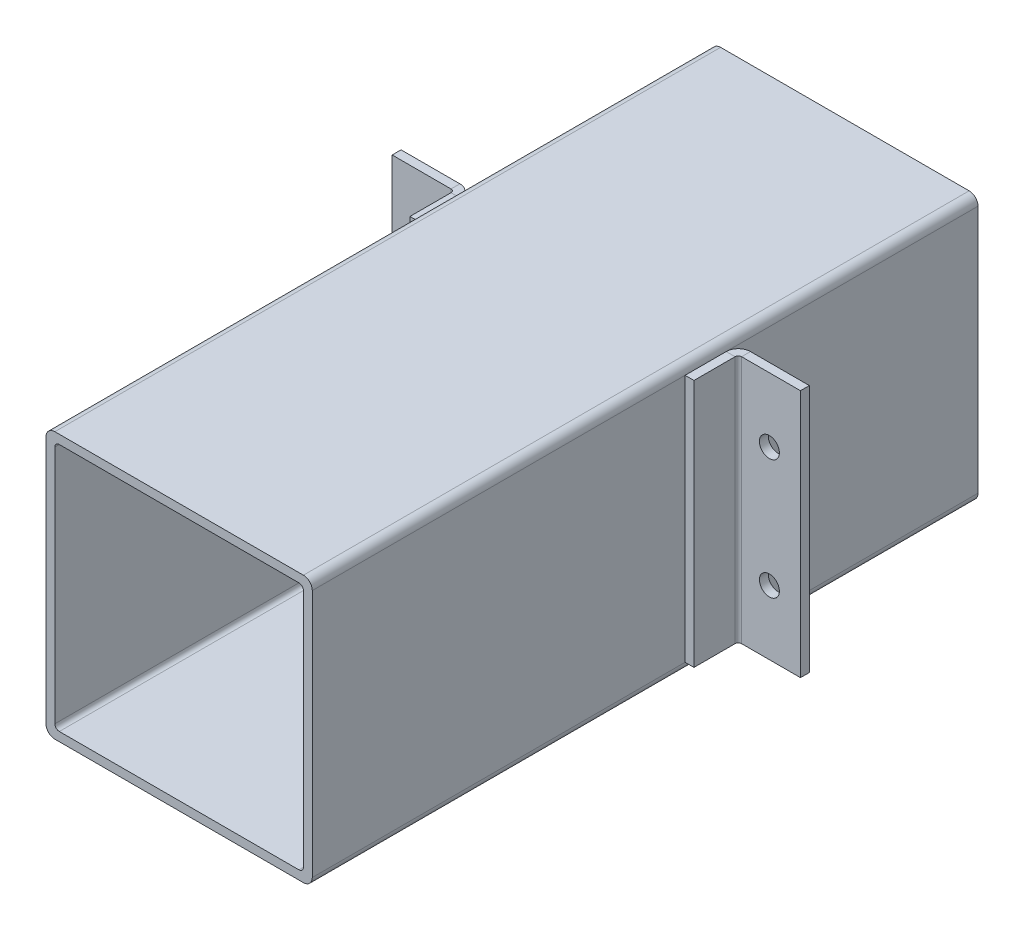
ISO-10303-21;
HEADER;
FILE_DESCRIPTION(('STEP AP214'),'2;1');
FILE_NAME('part.step','',(''),(''),'','','');
FILE_SCHEMA(('AUTOMOTIVE_DESIGN { 1 0 10303 214 1 1 1 1 }'));
ENDSEC;
DATA;
#1=APPLICATION_CONTEXT('core data for automotive mechanical design processes');
#2=APPLICATION_PROTOCOL_DEFINITION('international standard','automotive_design',2000,#1);
#3=PRODUCT_CONTEXT('',#1,'mechanical');
#4=PRODUCT('Part','Part','',(#3));
#5=PRODUCT_RELATED_PRODUCT_CATEGORY('part','',(#4));
#6=PRODUCT_DEFINITION_FORMATION('','',#4);
#7=PRODUCT_DEFINITION_CONTEXT('part definition',#1,'design');
#8=PRODUCT_DEFINITION('design','',#6,#7);
#9=PRODUCT_DEFINITION_SHAPE('','',#8);
#10=(LENGTH_UNIT() NAMED_UNIT(*) SI_UNIT(.MILLI.,.METRE.));
#11=(NAMED_UNIT(*) PLANE_ANGLE_UNIT() SI_UNIT($,.RADIAN.));
#12=(NAMED_UNIT(*) SI_UNIT($,.STERADIAN.) SOLID_ANGLE_UNIT());
#13=UNCERTAINTY_MEASURE_WITH_UNIT(LENGTH_MEASURE(1.E-05),#10,'distance_accuracy_value','');
#14=(GEOMETRIC_REPRESENTATION_CONTEXT(3) GLOBAL_UNCERTAINTY_ASSIGNED_CONTEXT((#13)) GLOBAL_UNIT_ASSIGNED_CONTEXT((#10,
#11,#12)) REPRESENTATION_CONTEXT('',''));
#15=CARTESIAN_POINT('',(0.,0.,0.));
#16=DIRECTION('',(0.,0.,1.));
#17=DIRECTION('',(1.,0.,0.));
#18=AXIS2_PLACEMENT_3D('',#15,#16,#17);
#19=CARTESIAN_POINT('',(32.,-28.,66.));
#20=DIRECTION('',(0.,1.,0.));
#21=DIRECTION('',(0.,0.,1.));
#22=AXIS2_PLACEMENT_3D('',#19,#20,#21);
#23=PLANE('',#22);
#24=DIRECTION('',(-1.,0.,0.));
#25=VECTOR('',#24,1.);
#26=CARTESIAN_POINT('',(32.,-28.,56.7366));
#27=LINE('',#26,#25);
#28=CARTESIAN_POINT('',(32.,-28.,56.7366));
#29=VERTEX_POINT('',#28);
#30=CARTESIAN_POINT('',(30.,-28.,56.7366));
#31=VERTEX_POINT('',#30);
#32=EDGE_CURVE('P0_E39',#29,#31,#27,.T.);
#33=ORIENTED_EDGE('',*,*,#32,.F.);
#34=DIRECTION('',(0.,0.,-1.));
#35=VECTOR('',#34,1.);
#36=CARTESIAN_POINT('',(32.,-28.,66.));
#37=LINE('',#36,#35);
#38=CARTESIAN_POINT('',(32.,-28.,66.));
#39=VERTEX_POINT('',#38);
#40=EDGE_CURVE('P0_E146',#39,#29,#37,.T.);
#41=ORIENTED_EDGE('',*,*,#40,.F.);
#42=DIRECTION('',(-1.,0.,0.));
#43=VECTOR('',#42,1.);
#44=CARTESIAN_POINT('',(32.,-28.,66.));
#45=LINE('',#44,#43);
#46=CARTESIAN_POINT('',(30.,-28.,66.));
#47=VERTEX_POINT('',#46);
#48=EDGE_CURVE('P0_E11',#39,#47,#45,.T.);
#49=ORIENTED_EDGE('',*,*,#48,.T.);
#50=DIRECTION('',(0.,0.,-1.));
#51=VECTOR('',#50,1.);
#52=CARTESIAN_POINT('',(30.,-28.,66.));
#53=LINE('',#52,#51);
#54=EDGE_CURVE('P0_E153',#47,#31,#53,.T.);
#55=ORIENTED_EDGE('',*,*,#54,.T.);
#56=EDGE_LOOP('',(#33,#41,#49,#55));
#57=FACE_BOUND('',#56,.T.);
#58=ADVANCED_FACE('P0_F16',(#57),#23,.F.);
#59=CARTESIAN_POINT('',(32.,28.,66.));
#60=DIRECTION('',(0.,-1.,0.));
#61=DIRECTION('',(0.,0.,-1.));
#62=AXIS2_PLACEMENT_3D('',#59,#60,#61);
#63=PLANE('',#62);
#64=DIRECTION('',(-1.,0.,0.));
#65=VECTOR('',#64,1.);
#66=CARTESIAN_POINT('',(32.,28.,56.7366));
#67=LINE('',#66,#65);
#68=CARTESIAN_POINT('',(32.,28.,56.7366));
#69=VERTEX_POINT('',#68);
#70=CARTESIAN_POINT('',(30.,28.,56.7366));
#71=VERTEX_POINT('',#70);
#72=EDGE_CURVE('P0_E130',#69,#71,#67,.T.);
#73=ORIENTED_EDGE('',*,*,#72,.T.);
#74=DIRECTION('',(0.,0.,1.));
#75=VECTOR('',#74,1.);
#76=CARTESIAN_POINT('',(30.,28.,66.));
#77=LINE('',#76,#75);
#78=CARTESIAN_POINT('',(30.,28.,66.));
#79=VERTEX_POINT('',#78);
#80=EDGE_CURVE('P0_E147',#71,#79,#77,.T.);
#81=ORIENTED_EDGE('',*,*,#80,.T.);
#82=DIRECTION('',(-1.,0.,0.));
#83=VECTOR('',#82,1.);
#84=CARTESIAN_POINT('',(32.,28.,66.));
#85=LINE('',#84,#83);
#86=CARTESIAN_POINT('',(32.,28.,66.));
#87=VERTEX_POINT('',#86);
#88=EDGE_CURVE('P0_E24',#87,#79,#85,.T.);
#89=ORIENTED_EDGE('',*,*,#88,.F.);
#90=DIRECTION('',(0.,0.,1.));
#91=VECTOR('',#90,1.);
#92=CARTESIAN_POINT('',(32.,28.,66.));
#93=LINE('',#92,#91);
#94=EDGE_CURVE('P0_E149',#69,#87,#93,.T.);
#95=ORIENTED_EDGE('',*,*,#94,.F.);
#96=EDGE_LOOP('',(#73,#81,#89,#95));
#97=FACE_BOUND('',#96,.T.);
#98=ADVANCED_FACE('P0_F168',(#97),#63,.F.);
#99=CARTESIAN_POINT('',(32.,0.,0.));
#100=DIRECTION('',(1.,0.,0.));
#101=DIRECTION('',(0.,0.,-1.));
#102=AXIS2_PLACEMENT_3D('',#99,#100,#101);
#103=PLANE('',#102);
#104=ORIENTED_EDGE('',*,*,#40,.T.);
#105=DIRECTION('',(0.,1.,0.));
#106=VECTOR('',#105,1.);
#107=CARTESIAN_POINT('',(32.,28.,56.7366));
#108=LINE('',#107,#106);
#109=EDGE_CURVE('P0_E31',#69,#29,#108,.F.);
#110=ORIENTED_EDGE('',*,*,#109,.F.);
#111=ORIENTED_EDGE('',*,*,#94,.T.);
#112=DIRECTION('',(0.,-1.,0.));
#113=VECTOR('',#112,1.);
#114=CARTESIAN_POINT('',(32.,28.,66.));
#115=LINE('',#114,#113);
#116=EDGE_CURVE('P0_E143',#87,#39,#115,.T.);
#117=ORIENTED_EDGE('',*,*,#116,.T.);
#118=EDGE_LOOP('',(#104,#110,#111,#117));
#119=FACE_BOUND('',#118,.T.);
#120=ADVANCED_FACE('P0_F166',(#119),#103,.T.);
#121=CARTESIAN_POINT('',(30.,0.,0.));
#122=DIRECTION('',(1.,0.,0.));
#123=DIRECTION('',(0.,0.,-1.));
#124=AXIS2_PLACEMENT_3D('',#121,#122,#123);
#125=PLANE('',#124);
#126=DIRECTION('',(0.,1.,0.));
#127=VECTOR('',#126,1.);
#128=CARTESIAN_POINT('',(30.,28.,56.7366));
#129=LINE('',#128,#127);
#130=EDGE_CURVE('P0_E124',#71,#31,#129,.F.);
#131=ORIENTED_EDGE('',*,*,#130,.T.);
#132=ORIENTED_EDGE('',*,*,#54,.F.);
#133=DIRECTION('',(0.,-1.,0.));
#134=VECTOR('',#133,1.);
#135=CARTESIAN_POINT('',(30.,28.,66.));
#136=LINE('',#135,#134);
#137=EDGE_CURVE('P0_E141',#79,#47,#136,.T.);
#138=ORIENTED_EDGE('',*,*,#137,.F.);
#139=ORIENTED_EDGE('',*,*,#80,.F.);
#140=EDGE_LOOP('',(#131,#132,#138,#139));
#141=FACE_BOUND('',#140,.T.);
#142=ADVANCED_FACE('P0_F164',(#141),#125,.F.);
#143=CARTESIAN_POINT('',(32.,28.,66.));
#144=DIRECTION('',(0.,0.,-1.));
#145=DIRECTION('',(-1.,0.,0.));
#146=AXIS2_PLACEMENT_3D('',#143,#144,#145);
#147=PLANE('',#146);
#148=ORIENTED_EDGE('',*,*,#137,.T.);
#149=ORIENTED_EDGE('',*,*,#48,.F.);
#150=ORIENTED_EDGE('',*,*,#116,.F.);
#151=ORIENTED_EDGE('',*,*,#88,.T.);
#152=EDGE_LOOP('',(#148,#149,#150,#151));
#153=FACE_BOUND('',#152,.T.);
#154=ADVANCED_FACE('P0_F18',(#153),#147,.F.);
#155=CARTESIAN_POINT('',(32.7366,-28.,56.7366));
#156=DIRECTION('',(0.,-1.,0.));
#157=DIRECTION('',(0.,0.,-1.));
#158=AXIS2_PLACEMENT_3D('',#155,#156,#157);
#159=PLANE('',#158);
#160=DIRECTION('',(0.,0.,1.));
#161=VECTOR('',#160,1.);
#162=CARTESIAN_POINT('',(32.7366,-28.,54.));
#163=LINE('',#162,#161);
#164=CARTESIAN_POINT('',(32.7366,-28.,56.));
#165=VERTEX_POINT('',#164);
#166=CARTESIAN_POINT('',(32.7366,-28.,54.));
#167=VERTEX_POINT('',#166);
#168=EDGE_CURVE('P0_E106',#165,#167,#163,.F.);
#169=ORIENTED_EDGE('',*,*,#168,.F.);
#170=CARTESIAN_POINT('',(32.7366,-28.,56.7366));
#171=DIRECTION('',(0.,1.,0.));
#172=DIRECTION('',(0.,0.,1.));
#173=AXIS2_PLACEMENT_3D('',#170,#171,#172);
#174=CIRCLE('',#173,0.7366);
#175=EDGE_CURVE('P0_E133',#29,#165,#174,.F.);
#176=ORIENTED_EDGE('',*,*,#175,.F.);
#177=ORIENTED_EDGE('',*,*,#32,.T.);
#178=CARTESIAN_POINT('',(32.7366,-28.,56.7366));
#179=DIRECTION('',(0.,1.,0.));
#180=DIRECTION('',(0.,0.,1.));
#181=AXIS2_PLACEMENT_3D('',#178,#179,#180);
#182=CIRCLE('',#181,2.7366);
#183=EDGE_CURVE('P0_E126',#31,#167,#182,.F.);
#184=ORIENTED_EDGE('',*,*,#183,.T.);
#185=EDGE_LOOP('',(#169,#176,#177,#184));
#186=FACE_BOUND('',#185,.T.);
#187=ADVANCED_FACE('P0_F233',(#186),#159,.T.);
#188=CARTESIAN_POINT('',(32.7366,28.,56.7366));
#189=DIRECTION('',(0.,-1.,0.));
#190=DIRECTION('',(0.,0.,-1.));
#191=AXIS2_PLACEMENT_3D('',#188,#189,#190);
#192=PLANE('',#191);
#193=CARTESIAN_POINT('',(32.7366,28.,56.7366));
#194=DIRECTION('',(0.,1.,0.));
#195=DIRECTION('',(0.,0.,1.));
#196=AXIS2_PLACEMENT_3D('',#193,#194,#195);
#197=CIRCLE('',#196,0.7366);
#198=CARTESIAN_POINT('',(32.7366,28.,56.));
#199=VERTEX_POINT('',#198);
#200=EDGE_CURVE('P0_E137',#199,#69,#197,.T.);
#201=ORIENTED_EDGE('',*,*,#200,.F.);
#202=DIRECTION('',(0.,0.,1.));
#203=VECTOR('',#202,1.);
#204=CARTESIAN_POINT('',(32.7366,28.,56.));
#205=LINE('',#204,#203);
#206=CARTESIAN_POINT('',(32.7366,28.,54.));
#207=VERTEX_POINT('',#206);
#208=EDGE_CURVE('P0_E117',#199,#207,#205,.F.);
#209=ORIENTED_EDGE('',*,*,#208,.T.);
#210=CARTESIAN_POINT('',(32.7366,28.,56.7366));
#211=DIRECTION('',(0.,1.,0.));
#212=DIRECTION('',(0.,0.,1.));
#213=AXIS2_PLACEMENT_3D('',#210,#211,#212);
#214=CIRCLE('',#213,2.7366);
#215=EDGE_CURVE('P0_E127',#207,#71,#214,.T.);
#216=ORIENTED_EDGE('',*,*,#215,.T.);
#217=ORIENTED_EDGE('',*,*,#72,.F.);
#218=EDGE_LOOP('',(#201,#209,#216,#217));
#219=FACE_BOUND('',#218,.T.);
#220=ADVANCED_FACE('P0_F171',(#219),#192,.F.);
#221=CARTESIAN_POINT('',(32.7366,28.,56.7366));
#222=DIRECTION('',(0.,1.,0.));
#223=DIRECTION('',(0.,0.,-1.));
#224=AXIS2_PLACEMENT_3D('',#221,#222,#223);
#225=CYLINDRICAL_SURFACE('',#224,2.7366);
#226=ORIENTED_EDGE('',*,*,#130,.F.);
#227=ORIENTED_EDGE('',*,*,#215,.F.);
#228=DIRECTION('',(0.,1.,0.));
#229=VECTOR('',#228,1.);
#230=CARTESIAN_POINT('',(32.7366,-28.,54.));
#231=LINE('',#230,#229);
#232=EDGE_CURVE('P0_E115',#207,#167,#231,.F.);
#233=ORIENTED_EDGE('',*,*,#232,.T.);
#234=ORIENTED_EDGE('',*,*,#183,.F.);
#235=EDGE_LOOP('',(#226,#227,#233,#234));
#236=FACE_BOUND('',#235,.T.);
#237=ADVANCED_FACE('P0_F232',(#236),#225,.T.);
#238=CARTESIAN_POINT('',(32.7366,28.,56.7366));
#239=DIRECTION('',(0.,1.,0.));
#240=DIRECTION('',(0.,0.,-1.));
#241=AXIS2_PLACEMENT_3D('',#238,#239,#240);
#242=CYLINDRICAL_SURFACE('',#241,0.7366);
#243=ORIENTED_EDGE('',*,*,#109,.T.);
#244=ORIENTED_EDGE('',*,*,#175,.T.);
#245=DIRECTION('',(0.,1.,0.));
#246=VECTOR('',#245,1.);
#247=CARTESIAN_POINT('',(32.7366,-28.,56.));
#248=LINE('',#247,#246);
#249=EDGE_CURVE('P0_E120',#165,#199,#248,.T.);
#250=ORIENTED_EDGE('',*,*,#249,.T.);
#251=ORIENTED_EDGE('',*,*,#200,.T.);
#252=EDGE_LOOP('',(#243,#244,#250,#251));
#253=FACE_BOUND('',#252,.T.);
#254=ADVANCED_FACE('P0_F174',(#253),#242,.F.);
#255=CARTESIAN_POINT('',(32.,-28.,54.));
#256=DIRECTION('',(0.,1.,0.));
#257=DIRECTION('',(0.,0.,1.));
#258=AXIS2_PLACEMENT_3D('',#255,#256,#257);
#259=PLANE('',#258);
#260=ORIENTED_EDGE('',*,*,#168,.T.);
#261=DIRECTION('',(-1.,0.,0.));
#262=VECTOR('',#261,1.);
#263=CARTESIAN_POINT('',(1.80367172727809E-13,-28.,54.));
#264=LINE('',#263,#262);
#265=CARTESIAN_POINT('',(46.,-28.,54.));
#266=VERTEX_POINT('',#265);
#267=EDGE_CURVE('P0_E87',#266,#167,#264,.T.);
#268=ORIENTED_EDGE('',*,*,#267,.F.);
#269=DIRECTION('',(0.,0.,1.));
#270=VECTOR('',#269,1.);
#271=CARTESIAN_POINT('',(46.,-28.,54.));
#272=LINE('',#271,#270);
#273=CARTESIAN_POINT('',(46.,-28.,56.));
#274=VERTEX_POINT('',#273);
#275=EDGE_CURVE('P0_E93',#266,#274,#272,.T.);
#276=ORIENTED_EDGE('',*,*,#275,.T.);
#277=DIRECTION('',(1.,0.,0.));
#278=VECTOR('',#277,1.);
#279=CARTESIAN_POINT('',(32.,-28.,56.));
#280=LINE('',#279,#278);
#281=EDGE_CURVE('P0_E113',#274,#165,#280,.F.);
#282=ORIENTED_EDGE('',*,*,#281,.T.);
#283=EDGE_LOOP('',(#260,#268,#276,#282));
#284=FACE_BOUND('',#283,.T.);
#285=ADVANCED_FACE('P0_F105',(#284),#259,.F.);
#286=CARTESIAN_POINT('',(46.,28.,54.));
#287=DIRECTION('',(0.,-1.,0.));
#288=DIRECTION('',(0.,0.,-1.));
#289=AXIS2_PLACEMENT_3D('',#286,#287,#288);
#290=PLANE('',#289);
#291=ORIENTED_EDGE('',*,*,#208,.F.);
#292=DIRECTION('',(-1.,0.,0.));
#293=VECTOR('',#292,1.);
#294=CARTESIAN_POINT('',(46.,28.,56.));
#295=LINE('',#294,#293);
#296=CARTESIAN_POINT('',(46.,28.,56.));
#297=VERTEX_POINT('',#296);
#298=EDGE_CURVE('P0_E109',#199,#297,#295,.F.);
#299=ORIENTED_EDGE('',*,*,#298,.T.);
#300=DIRECTION('',(0.,0.,1.));
#301=VECTOR('',#300,1.);
#302=CARTESIAN_POINT('',(46.,28.,54.));
#303=LINE('',#302,#301);
#304=CARTESIAN_POINT('',(46.,28.,54.));
#305=VERTEX_POINT('',#304);
#306=EDGE_CURVE('P0_E102',#305,#297,#303,.T.);
#307=ORIENTED_EDGE('',*,*,#306,.F.);
#308=DIRECTION('',(1.,0.,0.));
#309=VECTOR('',#308,1.);
#310=CARTESIAN_POINT('',(1.80367172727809E-13,28.,54.));
#311=LINE('',#310,#309);
#312=EDGE_CURVE('P0_E89',#207,#305,#311,.T.);
#313=ORIENTED_EDGE('',*,*,#312,.F.);
#314=EDGE_LOOP('',(#291,#299,#307,#313));
#315=FACE_BOUND('',#314,.T.);
#316=ADVANCED_FACE('P0_F181',(#315),#290,.F.);
#317=CARTESIAN_POINT('',(1.80367172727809E-13,0.,54.));
#318=DIRECTION('',(0.,0.,1.));
#319=DIRECTION('',(1.,0.,0.));
#320=AXIS2_PLACEMENT_3D('',#317,#318,#319);
#321=PLANE('',#320);
#322=CARTESIAN_POINT('',(39.,13.5,54.));
#323=DIRECTION('',(0.,0.,1.));
#324=DIRECTION('',(1.,0.,0.));
#325=AXIS2_PLACEMENT_3D('',#322,#323,#324);
#326=CIRCLE('',#325,2.25);
#327=CARTESIAN_POINT('',(41.25,13.5,54.));
#328=VERTEX_POINT('',#327);
#329=EDGE_CURVE('P0_E189',#328,#328,#326,.T.);
#330=ORIENTED_EDGE('',*,*,#329,.T.);
#331=EDGE_LOOP('',(#330));
#332=FACE_BOUND('',#331,.T.);
#333=CARTESIAN_POINT('',(39.,-13.5,54.));
#334=DIRECTION('',(0.,0.,1.));
#335=DIRECTION('',(1.,0.,0.));
#336=AXIS2_PLACEMENT_3D('',#333,#334,#335);
#337=CIRCLE('',#336,2.25);
#338=CARTESIAN_POINT('',(41.25,-13.5,54.));
#339=VERTEX_POINT('',#338);
#340=EDGE_CURVE('P0_E123',#339,#339,#337,.T.);
#341=ORIENTED_EDGE('',*,*,#340,.T.);
#342=EDGE_LOOP('',(#341));
#343=FACE_BOUND('',#342,.T.);
#344=ORIENTED_EDGE('',*,*,#232,.F.);
#345=ORIENTED_EDGE('',*,*,#312,.T.);
#346=DIRECTION('',(0.,-1.,0.));
#347=VECTOR('',#346,1.);
#348=CARTESIAN_POINT('',(46.,0.,54.));
#349=LINE('',#348,#347);
#350=EDGE_CURVE('P0_E82',#305,#266,#349,.T.);
#351=ORIENTED_EDGE('',*,*,#350,.T.);
#352=ORIENTED_EDGE('',*,*,#267,.T.);
#353=EDGE_LOOP('',(#344,#345,#351,#352));
#354=FACE_BOUND('',#353,.T.);
#355=ADVANCED_FACE('P0_F85',(#332,#343,#354),#321,.F.);
#356=CARTESIAN_POINT('',(1.87350135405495E-13,0.,56.));
#357=DIRECTION('',(0.,0.,1.));
#358=DIRECTION('',(1.,0.,0.));
#359=AXIS2_PLACEMENT_3D('',#356,#357,#358);
#360=PLANE('',#359);
#361=CARTESIAN_POINT('',(39.,13.5,56.));
#362=DIRECTION('',(0.,0.,1.));
#363=DIRECTION('',(1.,0.,0.));
#364=AXIS2_PLACEMENT_3D('',#361,#362,#363);
#365=CIRCLE('',#364,2.25);
#366=CARTESIAN_POINT('',(41.25,13.5,56.));
#367=VERTEX_POINT('',#366);
#368=EDGE_CURVE('P0_E192',#367,#367,#365,.T.);
#369=ORIENTED_EDGE('',*,*,#368,.F.);
#370=EDGE_LOOP('',(#369));
#371=FACE_BOUND('',#370,.T.);
#372=CARTESIAN_POINT('',(39.,-13.5,56.));
#373=DIRECTION('',(0.,0.,1.));
#374=DIRECTION('',(1.,0.,0.));
#375=AXIS2_PLACEMENT_3D('',#372,#373,#374);
#376=CIRCLE('',#375,2.25);
#377=CARTESIAN_POINT('',(41.25,-13.5,56.));
#378=VERTEX_POINT('',#377);
#379=EDGE_CURVE('P0_E186',#378,#378,#376,.T.);
#380=ORIENTED_EDGE('',*,*,#379,.F.);
#381=EDGE_LOOP('',(#380));
#382=FACE_BOUND('',#381,.T.);
#383=ORIENTED_EDGE('',*,*,#298,.F.);
#384=ORIENTED_EDGE('',*,*,#249,.F.);
#385=ORIENTED_EDGE('',*,*,#281,.F.);
#386=DIRECTION('',(0.,1.,0.));
#387=VECTOR('',#386,1.);
#388=CARTESIAN_POINT('',(46.,-28.,56.));
#389=LINE('',#388,#387);
#390=EDGE_CURVE('P0_E98',#297,#274,#389,.F.);
#391=ORIENTED_EDGE('',*,*,#390,.F.);
#392=EDGE_LOOP('',(#383,#384,#385,#391));
#393=FACE_BOUND('',#392,.T.);
#394=ADVANCED_FACE('P0_F179',(#371,#382,#393),#360,.T.);
#395=CARTESIAN_POINT('',(46.,-28.,54.));
#396=DIRECTION('',(-1.,0.,0.));
#397=DIRECTION('',(0.,0.,1.));
#398=AXIS2_PLACEMENT_3D('',#395,#396,#397);
#399=PLANE('',#398);
#400=ORIENTED_EDGE('',*,*,#390,.T.);
#401=ORIENTED_EDGE('',*,*,#275,.F.);
#402=ORIENTED_EDGE('',*,*,#350,.F.);
#403=ORIENTED_EDGE('',*,*,#306,.T.);
#404=EDGE_LOOP('',(#400,#401,#402,#403));
#405=FACE_BOUND('',#404,.T.);
#406=ADVANCED_FACE('P0_F96',(#405),#399,.F.);
#407=CARTESIAN_POINT('',(39.,-13.5,56.));
#408=DIRECTION('',(0.,0.,1.));
#409=DIRECTION('',(1.,0.,0.));
#410=AXIS2_PLACEMENT_3D('',#407,#408,#409);
#411=CYLINDRICAL_SURFACE('',#410,2.25);
#412=ORIENTED_EDGE('',*,*,#379,.T.);
#413=EDGE_LOOP('',(#412));
#414=FACE_BOUND('',#413,.T.);
#415=ORIENTED_EDGE('',*,*,#340,.F.);
#416=EDGE_LOOP('',(#415));
#417=FACE_BOUND('',#416,.T.);
#418=ADVANCED_FACE('P0_F204',(#414,#417),#411,.F.);
#419=CARTESIAN_POINT('',(39.,13.5,56.));
#420=DIRECTION('',(0.,0.,1.));
#421=DIRECTION('',(1.,0.,0.));
#422=AXIS2_PLACEMENT_3D('',#419,#420,#421);
#423=CYLINDRICAL_SURFACE('',#422,2.25);
#424=ORIENTED_EDGE('',*,*,#368,.T.);
#425=EDGE_LOOP('',(#424));
#426=FACE_BOUND('',#425,.T.);
#427=ORIENTED_EDGE('',*,*,#329,.F.);
#428=EDGE_LOOP('',(#427));
#429=FACE_BOUND('',#428,.T.);
#430=ADVANCED_FACE('P0_F196',(#426,#429),#423,.F.);
#431=CLOSED_SHELL('',(#58,#98,#120,#142,#154,#187,#220,#237,#254,#285,#316,#355,#394,#406,#418,#430));
#432=MANIFOLD_SOLID_BREP('P0_B1',#431);
#433=CARTESIAN_POINT('',(-32.,-28.,54.));
#434=DIRECTION('',(0.,1.,0.));
#435=DIRECTION('',(0.,0.,1.));
#436=AXIS2_PLACEMENT_3D('',#433,#434,#435);
#437=PLANE('',#436);
#438=DIRECTION('',(1.,0.,0.));
#439=VECTOR('',#438,1.);
#440=CARTESIAN_POINT('',(-32.,-28.,56.7366));
#441=LINE('',#440,#439);
#442=CARTESIAN_POINT('',(-32.,-28.,56.7366));
#443=VERTEX_POINT('',#442);
#444=CARTESIAN_POINT('',(-30.,-28.,56.7366));
#445=VERTEX_POINT('',#444);
#446=EDGE_CURVE('P1_E130',#443,#445,#441,.T.);
#447=ORIENTED_EDGE('',*,*,#446,.T.);
#448=DIRECTION('',(0.,0.,1.));
#449=VECTOR('',#448,1.);
#450=CARTESIAN_POINT('',(-30.,-28.,54.));
#451=LINE('',#450,#449);
#452=CARTESIAN_POINT('',(-30.,-28.,66.));
#453=VERTEX_POINT('',#452);
#454=EDGE_CURVE('P1_E141',#445,#453,#451,.T.);
#455=ORIENTED_EDGE('',*,*,#454,.T.);
#456=DIRECTION('',(1.,0.,0.));
#457=VECTOR('',#456,1.);
#458=CARTESIAN_POINT('',(-32.,-28.,66.));
#459=LINE('',#458,#457);
#460=CARTESIAN_POINT('',(-32.,-28.,66.));
#461=VERTEX_POINT('',#460);
#462=EDGE_CURVE('P1_E11',#461,#453,#459,.T.);
#463=ORIENTED_EDGE('',*,*,#462,.F.);
#464=DIRECTION('',(0.,0.,1.));
#465=VECTOR('',#464,1.);
#466=CARTESIAN_POINT('',(-32.,-28.,54.));
#467=LINE('',#466,#465);
#468=EDGE_CURVE('P1_E143',#443,#461,#467,.T.);
#469=ORIENTED_EDGE('',*,*,#468,.F.);
#470=EDGE_LOOP('',(#447,#455,#463,#469));
#471=FACE_BOUND('',#470,.T.);
#472=ADVANCED_FACE('P1_F16',(#471),#437,.F.);
#473=CARTESIAN_POINT('',(-32.,28.,54.));
#474=DIRECTION('',(0.,-1.,0.));
#475=DIRECTION('',(0.,0.,-1.));
#476=AXIS2_PLACEMENT_3D('',#473,#474,#475);
#477=PLANE('',#476);
#478=DIRECTION('',(1.,0.,0.));
#479=VECTOR('',#478,1.);
#480=CARTESIAN_POINT('',(-32.,28.,56.7366));
#481=LINE('',#480,#479);
#482=CARTESIAN_POINT('',(-32.,28.,56.7366));
#483=VERTEX_POINT('',#482);
#484=CARTESIAN_POINT('',(-30.,28.,56.7366));
#485=VERTEX_POINT('',#484);
#486=EDGE_CURVE('P1_E31',#483,#485,#481,.T.);
#487=ORIENTED_EDGE('',*,*,#486,.F.);
#488=DIRECTION('',(0.,0.,-1.));
#489=VECTOR('',#488,1.);
#490=CARTESIAN_POINT('',(-32.,28.,54.));
#491=LINE('',#490,#489);
#492=CARTESIAN_POINT('',(-32.,28.,66.));
#493=VERTEX_POINT('',#492);
#494=EDGE_CURVE('P1_E148',#493,#483,#491,.T.);
#495=ORIENTED_EDGE('',*,*,#494,.F.);
#496=DIRECTION('',(1.,0.,0.));
#497=VECTOR('',#496,1.);
#498=CARTESIAN_POINT('',(-32.,28.,66.));
#499=LINE('',#498,#497);
#500=CARTESIAN_POINT('',(-30.,28.,66.));
#501=VERTEX_POINT('',#500);
#502=EDGE_CURVE('P1_E24',#493,#501,#499,.T.);
#503=ORIENTED_EDGE('',*,*,#502,.T.);
#504=DIRECTION('',(0.,0.,-1.));
#505=VECTOR('',#504,1.);
#506=CARTESIAN_POINT('',(-30.,28.,54.));
#507=LINE('',#506,#505);
#508=EDGE_CURVE('P1_E146',#501,#485,#507,.T.);
#509=ORIENTED_EDGE('',*,*,#508,.T.);
#510=EDGE_LOOP('',(#487,#495,#503,#509));
#511=FACE_BOUND('',#510,.T.);
#512=ADVANCED_FACE('P1_F157',(#511),#477,.F.);
#513=CARTESIAN_POINT('',(-32.,0.,0.));
#514=DIRECTION('',(-1.,0.,0.));
#515=DIRECTION('',(0.,0.,1.));
#516=AXIS2_PLACEMENT_3D('',#513,#514,#515);
#517=PLANE('',#516);
#518=ORIENTED_EDGE('',*,*,#494,.T.);
#519=DIRECTION('',(0.,-1.,0.));
#520=VECTOR('',#519,1.);
#521=CARTESIAN_POINT('',(-32.,-28.,56.7366));
#522=LINE('',#521,#520);
#523=EDGE_CURVE('P1_E38',#443,#483,#522,.F.);
#524=ORIENTED_EDGE('',*,*,#523,.F.);
#525=ORIENTED_EDGE('',*,*,#468,.T.);
#526=DIRECTION('',(0.,1.,0.));
#527=VECTOR('',#526,1.);
#528=CARTESIAN_POINT('',(-32.,28.,66.));
#529=LINE('',#528,#527);
#530=EDGE_CURVE('P1_E145',#461,#493,#529,.T.);
#531=ORIENTED_EDGE('',*,*,#530,.T.);
#532=EDGE_LOOP('',(#518,#524,#525,#531));
#533=FACE_BOUND('',#532,.T.);
#534=ADVANCED_FACE('P1_F220',(#533),#517,.T.);
#535=CARTESIAN_POINT('',(-30.,0.,0.));
#536=DIRECTION('',(-1.,0.,0.));
#537=DIRECTION('',(0.,0.,1.));
#538=AXIS2_PLACEMENT_3D('',#535,#536,#537);
#539=PLANE('',#538);
#540=DIRECTION('',(0.,-1.,0.));
#541=VECTOR('',#540,1.);
#542=CARTESIAN_POINT('',(-30.,-28.,56.7366));
#543=LINE('',#542,#541);
#544=EDGE_CURVE('P1_E124',#445,#485,#543,.F.);
#545=ORIENTED_EDGE('',*,*,#544,.T.);
#546=ORIENTED_EDGE('',*,*,#508,.F.);
#547=DIRECTION('',(0.,1.,0.));
#548=VECTOR('',#547,1.);
#549=CARTESIAN_POINT('',(-30.,28.,66.));
#550=LINE('',#549,#548);
#551=EDGE_CURVE('P1_E151',#453,#501,#550,.T.);
#552=ORIENTED_EDGE('',*,*,#551,.F.);
#553=ORIENTED_EDGE('',*,*,#454,.F.);
#554=EDGE_LOOP('',(#545,#546,#552,#553));
#555=FACE_BOUND('',#554,.T.);
#556=ADVANCED_FACE('P1_F162',(#555),#539,.F.);
#557=CARTESIAN_POINT('',(-32.,28.,66.));
#558=DIRECTION('',(0.,0.,-1.));
#559=DIRECTION('',(-1.,0.,0.));
#560=AXIS2_PLACEMENT_3D('',#557,#558,#559);
#561=PLANE('',#560);
#562=ORIENTED_EDGE('',*,*,#551,.T.);
#563=ORIENTED_EDGE('',*,*,#502,.F.);
#564=ORIENTED_EDGE('',*,*,#530,.F.);
#565=ORIENTED_EDGE('',*,*,#462,.T.);
#566=EDGE_LOOP('',(#562,#563,#564,#565));
#567=FACE_BOUND('',#566,.T.);
#568=ADVANCED_FACE('P1_F204',(#567),#561,.F.);
#569=CARTESIAN_POINT('',(-32.7366,28.,56.7366));
#570=DIRECTION('',(0.,1.,0.));
#571=DIRECTION('',(0.,0.,1.));
#572=AXIS2_PLACEMENT_3D('',#569,#570,#571);
#573=PLANE('',#572);
#574=DIRECTION('',(0.,0.,1.));
#575=VECTOR('',#574,1.);
#576=CARTESIAN_POINT('',(-32.7366,28.,54.));
#577=LINE('',#576,#575);
#578=CARTESIAN_POINT('',(-32.7366,28.,56.));
#579=VERTEX_POINT('',#578);
#580=CARTESIAN_POINT('',(-32.7366,28.,54.));
#581=VERTEX_POINT('',#580);
#582=EDGE_CURVE('P1_E107',#579,#581,#577,.F.);
#583=ORIENTED_EDGE('',*,*,#582,.F.);
#584=CARTESIAN_POINT('',(-32.7366,28.,56.7366));
#585=DIRECTION('',(0.,-1.,0.));
#586=DIRECTION('',(0.,0.,-1.));
#587=AXIS2_PLACEMENT_3D('',#584,#585,#586);
#588=CIRCLE('',#587,0.7366);
#589=EDGE_CURVE('P1_E133',#483,#579,#588,.F.);
#590=ORIENTED_EDGE('',*,*,#589,.F.);
#591=ORIENTED_EDGE('',*,*,#486,.T.);
#592=CARTESIAN_POINT('',(-32.7366,28.,56.7366));
#593=DIRECTION('',(0.,-1.,0.));
#594=DIRECTION('',(0.,0.,-1.));
#595=AXIS2_PLACEMENT_3D('',#592,#593,#594);
#596=CIRCLE('',#595,2.7366);
#597=EDGE_CURVE('P1_E126',#485,#581,#596,.F.);
#598=ORIENTED_EDGE('',*,*,#597,.T.);
#599=EDGE_LOOP('',(#583,#590,#591,#598));
#600=FACE_BOUND('',#599,.T.);
#601=ADVANCED_FACE('P1_F202',(#600),#573,.T.);
#602=CARTESIAN_POINT('',(-32.7366,-28.,56.7366));
#603=DIRECTION('',(0.,1.,0.));
#604=DIRECTION('',(0.,0.,1.));
#605=AXIS2_PLACEMENT_3D('',#602,#603,#604);
#606=PLANE('',#605);
#607=CARTESIAN_POINT('',(-32.7366,-28.,56.7366));
#608=DIRECTION('',(0.,-1.,0.));
#609=DIRECTION('',(0.,0.,-1.));
#610=AXIS2_PLACEMENT_3D('',#607,#608,#609);
#611=CIRCLE('',#610,0.7366);
#612=CARTESIAN_POINT('',(-32.7366,-28.,56.));
#613=VERTEX_POINT('',#612);
#614=EDGE_CURVE('P1_E137',#613,#443,#611,.T.);
#615=ORIENTED_EDGE('',*,*,#614,.F.);
#616=DIRECTION('',(0.,0.,1.));
#617=VECTOR('',#616,1.);
#618=CARTESIAN_POINT('',(-32.7366,-28.,56.));
#619=LINE('',#618,#617);
#620=CARTESIAN_POINT('',(-32.7366,-28.,54.));
#621=VERTEX_POINT('',#620);
#622=EDGE_CURVE('P1_E118',#613,#621,#619,.F.);
#623=ORIENTED_EDGE('',*,*,#622,.T.);
#624=CARTESIAN_POINT('',(-32.7366,-28.,56.7366));
#625=DIRECTION('',(0.,-1.,0.));
#626=DIRECTION('',(0.,0.,-1.));
#627=AXIS2_PLACEMENT_3D('',#624,#625,#626);
#628=CIRCLE('',#627,2.7366);
#629=EDGE_CURVE('P1_E127',#621,#445,#628,.T.);
#630=ORIENTED_EDGE('',*,*,#629,.T.);
#631=ORIENTED_EDGE('',*,*,#446,.F.);
#632=EDGE_LOOP('',(#615,#623,#630,#631));
#633=FACE_BOUND('',#632,.T.);
#634=ADVANCED_FACE('P1_F171',(#633),#606,.F.);
#635=CARTESIAN_POINT('',(-32.7366,-28.,56.7366));
#636=DIRECTION('',(0.,-1.,0.));
#637=DIRECTION('',(0.,0.,-1.));
#638=AXIS2_PLACEMENT_3D('',#635,#636,#637);
#639=CYLINDRICAL_SURFACE('',#638,2.7366);
#640=ORIENTED_EDGE('',*,*,#544,.F.);
#641=ORIENTED_EDGE('',*,*,#629,.F.);
#642=DIRECTION('',(0.,-1.,0.));
#643=VECTOR('',#642,1.);
#644=CARTESIAN_POINT('',(-32.7366,28.,54.));
#645=LINE('',#644,#643);
#646=EDGE_CURVE('P1_E116',#621,#581,#645,.F.);
#647=ORIENTED_EDGE('',*,*,#646,.T.);
#648=ORIENTED_EDGE('',*,*,#597,.F.);
#649=EDGE_LOOP('',(#640,#641,#647,#648));
#650=FACE_BOUND('',#649,.T.);
#651=ADVANCED_FACE('P1_F167',(#650),#639,.T.);
#652=CARTESIAN_POINT('',(-32.7366,-28.,56.7366));
#653=DIRECTION('',(0.,-1.,0.));
#654=DIRECTION('',(0.,0.,-1.));
#655=AXIS2_PLACEMENT_3D('',#652,#653,#654);
#656=CYLINDRICAL_SURFACE('',#655,0.7366);
#657=ORIENTED_EDGE('',*,*,#523,.T.);
#658=ORIENTED_EDGE('',*,*,#589,.T.);
#659=DIRECTION('',(0.,-1.,0.));
#660=VECTOR('',#659,1.);
#661=CARTESIAN_POINT('',(-32.7366,28.,56.));
#662=LINE('',#661,#660);
#663=EDGE_CURVE('P1_E121',#579,#613,#662,.T.);
#664=ORIENTED_EDGE('',*,*,#663,.T.);
#665=ORIENTED_EDGE('',*,*,#614,.T.);
#666=EDGE_LOOP('',(#657,#658,#664,#665));
#667=FACE_BOUND('',#666,.T.);
#668=ADVANCED_FACE('P1_F199',(#667),#656,.F.);
#669=CARTESIAN_POINT('',(-32.,28.,54.));
#670=DIRECTION('',(0.,-1.,0.));
#671=DIRECTION('',(1.,0.,0.));
#672=AXIS2_PLACEMENT_3D('',#669,#670,#671);
#673=PLANE('',#672);
#674=ORIENTED_EDGE('',*,*,#582,.T.);
#675=DIRECTION('',(1.,0.,0.));
#676=VECTOR('',#675,1.);
#677=CARTESIAN_POINT('',(-1.93253689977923E-13,28.,54.));
#678=LINE('',#677,#676);
#679=CARTESIAN_POINT('',(-46.,28.,54.));
#680=VERTEX_POINT('',#679);
#681=EDGE_CURVE('P1_E88',#680,#581,#678,.T.);
#682=ORIENTED_EDGE('',*,*,#681,.F.);
#683=DIRECTION('',(0.,0.,1.));
#684=VECTOR('',#683,1.);
#685=CARTESIAN_POINT('',(-46.,28.,54.));
#686=LINE('',#685,#684);
#687=CARTESIAN_POINT('',(-46.,28.,56.));
#688=VERTEX_POINT('',#687);
#689=EDGE_CURVE('P1_E94',#680,#688,#686,.T.);
#690=ORIENTED_EDGE('',*,*,#689,.T.);
#691=DIRECTION('',(-1.,0.,0.));
#692=VECTOR('',#691,1.);
#693=CARTESIAN_POINT('',(-32.,28.,56.));
#694=LINE('',#693,#692);
#695=EDGE_CURVE('P1_E114',#688,#579,#694,.F.);
#696=ORIENTED_EDGE('',*,*,#695,.T.);
#697=EDGE_LOOP('',(#674,#682,#690,#696));
#698=FACE_BOUND('',#697,.T.);
#699=ADVANCED_FACE('P1_F106',(#698),#673,.F.);
#700=CARTESIAN_POINT('',(-46.,-28.,54.));
#701=DIRECTION('',(0.,1.,0.));
#702=DIRECTION('',(-1.,0.,0.));
#703=AXIS2_PLACEMENT_3D('',#700,#701,#702);
#704=PLANE('',#703);
#705=ORIENTED_EDGE('',*,*,#622,.F.);
#706=DIRECTION('',(1.,0.,0.));
#707=VECTOR('',#706,1.);
#708=CARTESIAN_POINT('',(-46.,-28.,56.));
#709=LINE('',#708,#707);
#710=CARTESIAN_POINT('',(-46.,-28.,56.));
#711=VERTEX_POINT('',#710);
#712=EDGE_CURVE('P1_E110',#613,#711,#709,.F.);
#713=ORIENTED_EDGE('',*,*,#712,.T.);
#714=DIRECTION('',(0.,0.,1.));
#715=VECTOR('',#714,1.);
#716=CARTESIAN_POINT('',(-46.,-28.,54.));
#717=LINE('',#716,#715);
#718=CARTESIAN_POINT('',(-46.,-28.,54.));
#719=VERTEX_POINT('',#718);
#720=EDGE_CURVE('P1_E103',#719,#711,#717,.T.);
#721=ORIENTED_EDGE('',*,*,#720,.F.);
#722=DIRECTION('',(-1.,0.,0.));
#723=VECTOR('',#722,1.);
#724=CARTESIAN_POINT('',(-2.21009265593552E-13,-28.,54.));
#725=LINE('',#724,#723);
#726=EDGE_CURVE('P1_E90',#621,#719,#725,.T.);
#727=ORIENTED_EDGE('',*,*,#726,.F.);
#728=EDGE_LOOP('',(#705,#713,#721,#727));
#729=FACE_BOUND('',#728,.T.);
#730=ADVANCED_FACE('P1_F175',(#729),#704,.F.);
#731=CARTESIAN_POINT('',(-2.07131477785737E-13,0.,54.));
#732=DIRECTION('',(0.,0.,1.));
#733=DIRECTION('',(1.,0.,0.));
#734=AXIS2_PLACEMENT_3D('',#731,#732,#733);
#735=PLANE('',#734);
#736=CARTESIAN_POINT('',(-39.,-13.5,54.));
#737=DIRECTION('',(0.,0.,1.));
#738=DIRECTION('',(1.,0.,0.));
#739=AXIS2_PLACEMENT_3D('',#736,#737,#738);
#740=CIRCLE('',#739,2.25);
#741=CARTESIAN_POINT('',(-36.75,-13.5,54.));
#742=VERTEX_POINT('',#741);
#743=EDGE_CURVE('P1_E181',#742,#742,#740,.T.);
#744=ORIENTED_EDGE('',*,*,#743,.T.);
#745=EDGE_LOOP('',(#744));
#746=FACE_BOUND('',#745,.T.);
#747=CARTESIAN_POINT('',(-39.,13.5,54.));
#748=DIRECTION('',(0.,0.,1.));
#749=DIRECTION('',(1.,0.,0.));
#750=AXIS2_PLACEMENT_3D('',#747,#748,#749);
#751=CIRCLE('',#750,2.25);
#752=CARTESIAN_POINT('',(-36.75,13.5,54.));
#753=VERTEX_POINT('',#752);
#754=EDGE_CURVE('P1_E19',#753,#753,#751,.T.);
#755=ORIENTED_EDGE('',*,*,#754,.T.);
#756=EDGE_LOOP('',(#755));
#757=FACE_BOUND('',#756,.T.);
#758=ORIENTED_EDGE('',*,*,#646,.F.);
#759=ORIENTED_EDGE('',*,*,#726,.T.);
#760=DIRECTION('',(0.,1.,0.));
#761=VECTOR('',#760,1.);
#762=CARTESIAN_POINT('',(-46.,0.,54.));
#763=LINE('',#762,#761);
#764=EDGE_CURVE('P1_E83',#719,#680,#763,.T.);
#765=ORIENTED_EDGE('',*,*,#764,.T.);
#766=ORIENTED_EDGE('',*,*,#681,.T.);
#767=EDGE_LOOP('',(#758,#759,#765,#766));
#768=FACE_BOUND('',#767,.T.);
#769=ADVANCED_FACE('P1_F86',(#746,#757,#768),#735,.F.);
#770=CARTESIAN_POINT('',(-2.14114440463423E-13,0.,56.));
#771=DIRECTION('',(0.,0.,1.));
#772=DIRECTION('',(1.,0.,0.));
#773=AXIS2_PLACEMENT_3D('',#770,#771,#772);
#774=PLANE('',#773);
#775=CARTESIAN_POINT('',(-39.,-13.5,56.));
#776=DIRECTION('',(0.,0.,1.));
#777=DIRECTION('',(1.,0.,0.));
#778=AXIS2_PLACEMENT_3D('',#775,#776,#777);
#779=CIRCLE('',#778,2.25);
#780=CARTESIAN_POINT('',(-36.75,-13.5,56.));
#781=VERTEX_POINT('',#780);
#782=EDGE_CURVE('P1_E184',#781,#781,#779,.T.);
#783=ORIENTED_EDGE('',*,*,#782,.F.);
#784=EDGE_LOOP('',(#783));
#785=FACE_BOUND('',#784,.T.);
#786=CARTESIAN_POINT('',(-39.,13.5,56.));
#787=DIRECTION('',(0.,0.,1.));
#788=DIRECTION('',(1.,0.,0.));
#789=AXIS2_PLACEMENT_3D('',#786,#787,#788);
#790=CIRCLE('',#789,2.25);
#791=CARTESIAN_POINT('',(-36.75,13.5,56.));
#792=VERTEX_POINT('',#791);
#793=EDGE_CURVE('P1_E178',#792,#792,#790,.T.);
#794=ORIENTED_EDGE('',*,*,#793,.F.);
#795=EDGE_LOOP('',(#794));
#796=FACE_BOUND('',#795,.T.);
#797=ORIENTED_EDGE('',*,*,#712,.F.);
#798=ORIENTED_EDGE('',*,*,#663,.F.);
#799=ORIENTED_EDGE('',*,*,#695,.F.);
#800=DIRECTION('',(0.,-1.,0.));
#801=VECTOR('',#800,1.);
#802=CARTESIAN_POINT('',(-46.,28.,56.));
#803=LINE('',#802,#801);
#804=EDGE_CURVE('P1_E99',#711,#688,#803,.F.);
#805=ORIENTED_EDGE('',*,*,#804,.F.);
#806=EDGE_LOOP('',(#797,#798,#799,#805));
#807=FACE_BOUND('',#806,.T.);
#808=ADVANCED_FACE('P1_F191',(#785,#796,#807),#774,.T.);
#809=CARTESIAN_POINT('',(-46.,28.,54.));
#810=DIRECTION('',(1.,0.,0.));
#811=DIRECTION('',(0.,0.,-1.));
#812=AXIS2_PLACEMENT_3D('',#809,#810,#811);
#813=PLANE('',#812);
#814=ORIENTED_EDGE('',*,*,#804,.T.);
#815=ORIENTED_EDGE('',*,*,#689,.F.);
#816=ORIENTED_EDGE('',*,*,#764,.F.);
#817=ORIENTED_EDGE('',*,*,#720,.T.);
#818=EDGE_LOOP('',(#814,#815,#816,#817));
#819=FACE_BOUND('',#818,.T.);
#820=ADVANCED_FACE('P1_F97',(#819),#813,.F.);
#821=CARTESIAN_POINT('',(-39.,13.5,56.));
#822=DIRECTION('',(0.,0.,1.));
#823=DIRECTION('',(1.,0.,0.));
#824=AXIS2_PLACEMENT_3D('',#821,#822,#823);
#825=CYLINDRICAL_SURFACE('',#824,2.25);
#826=ORIENTED_EDGE('',*,*,#793,.T.);
#827=EDGE_LOOP('',(#826));
#828=FACE_BOUND('',#827,.T.);
#829=ORIENTED_EDGE('',*,*,#754,.F.);
#830=EDGE_LOOP('',(#829));
#831=FACE_BOUND('',#830,.T.);
#832=ADVANCED_FACE('P1_F307',(#828,#831),#825,.F.);
#833=CARTESIAN_POINT('',(-39.,-13.5,56.));
#834=DIRECTION('',(0.,0.,1.));
#835=DIRECTION('',(1.,0.,0.));
#836=AXIS2_PLACEMENT_3D('',#833,#834,#835);
#837=CYLINDRICAL_SURFACE('',#836,2.25);
#838=ORIENTED_EDGE('',*,*,#782,.T.);
#839=EDGE_LOOP('',(#838));
#840=FACE_BOUND('',#839,.T.);
#841=ORIENTED_EDGE('',*,*,#743,.F.);
#842=EDGE_LOOP('',(#841));
#843=FACE_BOUND('',#842,.T.);
#844=ADVANCED_FACE('P1_F188',(#840,#843),#837,.F.);
#845=CLOSED_SHELL('',(#472,#512,#534,#556,#568,#601,#634,#651,#668,#699,#730,#769,#808,#820,
#832,#844));
#846=MANIFOLD_SOLID_BREP('P1_B1',#845);
#847=CARTESIAN_POINT('',(-28.,-28.,150.));
#848=DIRECTION('',(0.,0.,-1.));
#849=DIRECTION('',(-1.,0.,0.));
#850=AXIS2_PLACEMENT_3D('',#847,#848,#849);
#851=CYLINDRICAL_SURFACE('',#850,2.);
#852=CARTESIAN_POINT('',(-28.,-28.,0.));
#853=DIRECTION('',(0.,0.,1.));
#854=DIRECTION('',(1.,0.,0.));
#855=AXIS2_PLACEMENT_3D('',#852,#853,#854);
#856=CIRCLE('',#855,2.);
#857=CARTESIAN_POINT('',(-30.,-28.,0.));
#858=VERTEX_POINT('',#857);
#859=CARTESIAN_POINT('',(-28.,-30.,0.));
#860=VERTEX_POINT('',#859);
#861=EDGE_CURVE('P2_E185',#858,#860,#856,.T.);
#862=ORIENTED_EDGE('',*,*,#861,.T.);
#863=DIRECTION('',(0.,0.,-1.));
#864=VECTOR('',#863,1.);
#865=CARTESIAN_POINT('',(-28.,-30.,150.));
#866=LINE('',#865,#864);
#867=CARTESIAN_POINT('',(-28.,-30.,150.));
#868=VERTEX_POINT('',#867);
#869=EDGE_CURVE('P2_E11',#868,#860,#866,.T.);
#870=ORIENTED_EDGE('',*,*,#869,.F.);
#871=CARTESIAN_POINT('',(-28.,-28.,150.));
#872=DIRECTION('',(0.,0.,1.));
#873=DIRECTION('',(1.,0.,0.));
#874=AXIS2_PLACEMENT_3D('',#871,#872,#873);
#875=CIRCLE('',#874,2.);
#876=CARTESIAN_POINT('',(-30.,-28.,150.));
#877=VERTEX_POINT('',#876);
#878=EDGE_CURVE('P2_E197',#877,#868,#875,.T.);
#879=ORIENTED_EDGE('',*,*,#878,.F.);
#880=DIRECTION('',(0.,0.,-1.));
#881=VECTOR('',#880,1.);
#882=CARTESIAN_POINT('',(-30.,-28.,150.));
#883=LINE('',#882,#881);
#884=EDGE_CURVE('P2_E215',#877,#858,#883,.T.);
#885=ORIENTED_EDGE('',*,*,#884,.T.);
#886=EDGE_LOOP('',(#862,#870,#879,#885));
#887=FACE_BOUND('',#886,.T.);
#888=ADVANCED_FACE('P2_F16',(#887),#851,.T.);
#889=CARTESIAN_POINT('',(-28.,-30.,150.));
#890=DIRECTION('',(0.,1.,0.));
#891=DIRECTION('',(0.,0.,1.));
#892=AXIS2_PLACEMENT_3D('',#889,#890,#891);
#893=PLANE('',#892);
#894=DIRECTION('',(1.,0.,0.));
#895=VECTOR('',#894,1.);
#896=CARTESIAN_POINT('',(-28.,-30.,0.));
#897=LINE('',#896,#895);
#898=CARTESIAN_POINT('',(28.,-30.,0.));
#899=VERTEX_POINT('',#898);
#900=EDGE_CURVE('P2_E218',#860,#899,#897,.T.);
#901=ORIENTED_EDGE('',*,*,#900,.T.);
#902=DIRECTION('',(0.,0.,-1.));
#903=VECTOR('',#902,1.);
#904=CARTESIAN_POINT('',(28.,-30.,150.));
#905=LINE('',#904,#903);
#906=CARTESIAN_POINT('',(28.,-30.,150.));
#907=VERTEX_POINT('',#906);
#908=EDGE_CURVE('P2_E23',#907,#899,#905,.T.);
#909=ORIENTED_EDGE('',*,*,#908,.F.);
#910=DIRECTION('',(1.,0.,0.));
#911=VECTOR('',#910,1.);
#912=CARTESIAN_POINT('',(-28.,-30.,150.));
#913=LINE('',#912,#911);
#914=EDGE_CURVE('P2_E200',#868,#907,#913,.T.);
#915=ORIENTED_EDGE('',*,*,#914,.F.);
#916=ORIENTED_EDGE('',*,*,#869,.T.);
#917=EDGE_LOOP('',(#901,#909,#915,#916));
#918=FACE_BOUND('',#917,.T.);
#919=ADVANCED_FACE('P2_F273',(#918),#893,.F.);
#920=CARTESIAN_POINT('',(28.,-28.,150.));
#921=DIRECTION('',(0.,0.,-1.));
#922=DIRECTION('',(-1.,0.,0.));
#923=AXIS2_PLACEMENT_3D('',#920,#921,#922);
#924=CYLINDRICAL_SURFACE('',#923,2.);
#925=CARTESIAN_POINT('',(28.,-28.,0.));
#926=DIRECTION('',(0.,0.,1.));
#927=DIRECTION('',(1.,0.,0.));
#928=AXIS2_PLACEMENT_3D('',#925,#926,#927);
#929=CIRCLE('',#928,2.);
#930=CARTESIAN_POINT('',(30.,-28.,0.));
#931=VERTEX_POINT('',#930);
#932=EDGE_CURVE('P2_E220',#899,#931,#929,.T.);
#933=ORIENTED_EDGE('',*,*,#932,.T.);
#934=DIRECTION('',(0.,0.,-1.));
#935=VECTOR('',#934,1.);
#936=CARTESIAN_POINT('',(30.,-28.,150.));
#937=LINE('',#936,#935);
#938=CARTESIAN_POINT('',(30.,-28.,150.));
#939=VERTEX_POINT('',#938);
#940=EDGE_CURVE('P2_E245',#939,#931,#937,.T.);
#941=ORIENTED_EDGE('',*,*,#940,.F.);
#942=CARTESIAN_POINT('',(28.,-28.,150.));
#943=DIRECTION('',(0.,0.,1.));
#944=DIRECTION('',(1.,0.,0.));
#945=AXIS2_PLACEMENT_3D('',#942,#943,#944);
#946=CIRCLE('',#945,2.);
#947=EDGE_CURVE('P2_E203',#907,#939,#946,.T.);
#948=ORIENTED_EDGE('',*,*,#947,.F.);
#949=ORIENTED_EDGE('',*,*,#908,.T.);
#950=EDGE_LOOP('',(#933,#941,#948,#949));
#951=FACE_BOUND('',#950,.T.);
#952=ADVANCED_FACE('P2_F252',(#951),#924,.T.);
#953=CARTESIAN_POINT('',(30.,28.,150.));
#954=DIRECTION('',(-1.,0.,0.));
#955=DIRECTION('',(0.,0.,1.));
#956=AXIS2_PLACEMENT_3D('',#953,#954,#955);
#957=PLANE('',#956);
#958=DIRECTION('',(0.,1.,0.));
#959=VECTOR('',#958,1.);
#960=CARTESIAN_POINT('',(30.,28.,0.));
#961=LINE('',#960,#959);
#962=CARTESIAN_POINT('',(30.,28.,0.));
#963=VERTEX_POINT('',#962);
#964=EDGE_CURVE('P2_E222',#931,#963,#961,.T.);
#965=ORIENTED_EDGE('',*,*,#964,.T.);
#966=DIRECTION('',(0.,0.,-1.));
#967=VECTOR('',#966,1.);
#968=CARTESIAN_POINT('',(30.,28.,150.));
#969=LINE('',#968,#967);
#970=CARTESIAN_POINT('',(30.,28.,150.));
#971=VERTEX_POINT('',#970);
#972=EDGE_CURVE('P2_E242',#971,#963,#969,.T.);
#973=ORIENTED_EDGE('',*,*,#972,.F.);
#974=DIRECTION('',(0.,1.,0.));
#975=VECTOR('',#974,1.);
#976=CARTESIAN_POINT('',(30.,28.,150.));
#977=LINE('',#976,#975);
#978=EDGE_CURVE('P2_E205',#939,#971,#977,.T.);
#979=ORIENTED_EDGE('',*,*,#978,.F.);
#980=ORIENTED_EDGE('',*,*,#940,.T.);
#981=EDGE_LOOP('',(#965,#973,#979,#980));
#982=FACE_BOUND('',#981,.T.);
#983=ADVANCED_FACE('P2_F261',(#982),#957,.F.);
#984=CARTESIAN_POINT('',(28.,28.,150.));
#985=DIRECTION('',(0.,0.,-1.));
#986=DIRECTION('',(-1.,0.,0.));
#987=AXIS2_PLACEMENT_3D('',#984,#985,#986);
#988=CYLINDRICAL_SURFACE('',#987,2.);
#989=CARTESIAN_POINT('',(28.,28.,0.));
#990=DIRECTION('',(0.,0.,1.));
#991=DIRECTION('',(-1.,0.,0.));
#992=AXIS2_PLACEMENT_3D('',#989,#990,#991);
#993=CIRCLE('',#992,2.);
#994=CARTESIAN_POINT('',(28.,30.,0.));
#995=VERTEX_POINT('',#994);
#996=EDGE_CURVE('P2_E224',#963,#995,#993,.T.);
#997=ORIENTED_EDGE('',*,*,#996,.T.);
#998=DIRECTION('',(0.,0.,-1.));
#999=VECTOR('',#998,1.);
#1000=CARTESIAN_POINT('',(28.,30.,150.));
#1001=LINE('',#1000,#999);
#1002=CARTESIAN_POINT('',(28.,30.,150.));
#1003=VERTEX_POINT('',#1002);
#1004=EDGE_CURVE('P2_E239',#1003,#995,#1001,.T.);
#1005=ORIENTED_EDGE('',*,*,#1004,.F.);
#1006=CARTESIAN_POINT('',(28.,28.,150.));
#1007=DIRECTION('',(0.,0.,1.));
#1008=DIRECTION('',(-1.,0.,0.));
#1009=AXIS2_PLACEMENT_3D('',#1006,#1007,#1008);
#1010=CIRCLE('',#1009,2.);
#1011=EDGE_CURVE('P2_E207',#971,#1003,#1010,.T.);
#1012=ORIENTED_EDGE('',*,*,#1011,.F.);
#1013=ORIENTED_EDGE('',*,*,#972,.T.);
#1014=EDGE_LOOP('',(#997,#1005,#1012,#1013));
#1015=FACE_BOUND('',#1014,.T.);
#1016=ADVANCED_FACE('P2_F265',(#1015),#988,.T.);
#1017=CARTESIAN_POINT('',(-28.,30.,150.));
#1018=DIRECTION('',(0.,-1.,0.));
#1019=DIRECTION('',(0.,0.,-1.));
#1020=AXIS2_PLACEMENT_3D('',#1017,#1018,#1019);
#1021=PLANE('',#1020);
#1022=DIRECTION('',(-1.,0.,0.));
#1023=VECTOR('',#1022,1.);
#1024=CARTESIAN_POINT('',(-28.,30.,0.));
#1025=LINE('',#1024,#1023);
#1026=CARTESIAN_POINT('',(-28.,30.,0.));
#1027=VERTEX_POINT('',#1026);
#1028=EDGE_CURVE('P2_E226',#995,#1027,#1025,.T.);
#1029=ORIENTED_EDGE('',*,*,#1028,.T.);
#1030=DIRECTION('',(0.,0.,-1.));
#1031=VECTOR('',#1030,1.);
#1032=CARTESIAN_POINT('',(-28.,30.,150.));
#1033=LINE('',#1032,#1031);
#1034=CARTESIAN_POINT('',(-28.,30.,150.));
#1035=VERTEX_POINT('',#1034);
#1036=EDGE_CURVE('P2_E236',#1035,#1027,#1033,.T.);
#1037=ORIENTED_EDGE('',*,*,#1036,.F.);
#1038=DIRECTION('',(-1.,0.,0.));
#1039=VECTOR('',#1038,1.);
#1040=CARTESIAN_POINT('',(-28.,30.,150.));
#1041=LINE('',#1040,#1039);
#1042=EDGE_CURVE('P2_E209',#1003,#1035,#1041,.T.);
#1043=ORIENTED_EDGE('',*,*,#1042,.F.);
#1044=ORIENTED_EDGE('',*,*,#1004,.T.);
#1045=EDGE_LOOP('',(#1029,#1037,#1043,#1044));
#1046=FACE_BOUND('',#1045,.T.);
#1047=ADVANCED_FACE('P2_F286',(#1046),#1021,.F.);
#1048=CARTESIAN_POINT('',(-28.,28.,150.));
#1049=DIRECTION('',(0.,0.,-1.));
#1050=DIRECTION('',(-1.,0.,0.));
#1051=AXIS2_PLACEMENT_3D('',#1048,#1049,#1050);
#1052=CYLINDRICAL_SURFACE('',#1051,2.);
#1053=CARTESIAN_POINT('',(-28.,28.,0.));
#1054=DIRECTION('',(0.,0.,1.));
#1055=DIRECTION('',(1.,0.,0.));
#1056=AXIS2_PLACEMENT_3D('',#1053,#1054,#1055);
#1057=CIRCLE('',#1056,2.);
#1058=CARTESIAN_POINT('',(-30.,28.,0.));
#1059=VERTEX_POINT('',#1058);
#1060=EDGE_CURVE('P2_E228',#1027,#1059,#1057,.T.);
#1061=ORIENTED_EDGE('',*,*,#1060,.T.);
#1062=DIRECTION('',(0.,0.,-1.));
#1063=VECTOR('',#1062,1.);
#1064=CARTESIAN_POINT('',(-30.,28.,150.));
#1065=LINE('',#1064,#1063);
#1066=CARTESIAN_POINT('',(-30.,28.,150.));
#1067=VERTEX_POINT('',#1066);
#1068=EDGE_CURVE('P2_E233',#1067,#1059,#1065,.T.);
#1069=ORIENTED_EDGE('',*,*,#1068,.F.);
#1070=CARTESIAN_POINT('',(-28.,28.,150.));
#1071=DIRECTION('',(0.,0.,1.));
#1072=DIRECTION('',(1.,0.,0.));
#1073=AXIS2_PLACEMENT_3D('',#1070,#1071,#1072);
#1074=CIRCLE('',#1073,2.);
#1075=EDGE_CURVE('P2_E211',#1035,#1067,#1074,.T.);
#1076=ORIENTED_EDGE('',*,*,#1075,.F.);
#1077=ORIENTED_EDGE('',*,*,#1036,.T.);
#1078=EDGE_LOOP('',(#1061,#1069,#1076,#1077));
#1079=FACE_BOUND('',#1078,.T.);
#1080=ADVANCED_FACE('P2_F284',(#1079),#1052,.T.);
#1081=CARTESIAN_POINT('',(-30.,28.,150.));
#1082=DIRECTION('',(1.,0.,0.));
#1083=DIRECTION('',(0.,0.,-1.));
#1084=AXIS2_PLACEMENT_3D('',#1081,#1082,#1083);
#1085=PLANE('',#1084);
#1086=DIRECTION('',(0.,-1.,0.));
#1087=VECTOR('',#1086,1.);
#1088=CARTESIAN_POINT('',(-30.,28.,0.));
#1089=LINE('',#1088,#1087);
#1090=EDGE_CURVE('P2_E201',#1059,#858,#1089,.T.);
#1091=ORIENTED_EDGE('',*,*,#1090,.T.);
#1092=ORIENTED_EDGE('',*,*,#884,.F.);
#1093=DIRECTION('',(0.,-1.,0.));
#1094=VECTOR('',#1093,1.);
#1095=CARTESIAN_POINT('',(-30.,28.,150.));
#1096=LINE('',#1095,#1094);
#1097=EDGE_CURVE('P2_E213',#1067,#877,#1096,.T.);
#1098=ORIENTED_EDGE('',*,*,#1097,.F.);
#1099=ORIENTED_EDGE('',*,*,#1068,.T.);
#1100=EDGE_LOOP('',(#1091,#1092,#1098,#1099));
#1101=FACE_BOUND('',#1100,.T.);
#1102=ADVANCED_FACE('P2_F279',(#1101),#1085,.F.);
#1103=CARTESIAN_POINT('',(-28.,-28.,150.));
#1104=DIRECTION('',(0.,0.,1.));
#1105=DIRECTION('',(1.,0.,0.));
#1106=AXIS2_PLACEMENT_3D('',#1103,#1104,#1105);
#1107=PLANE('',#1106);
#1108=CARTESIAN_POINT('',(-27.,-27.,150.));
#1109=DIRECTION('',(0.,0.,1.));
#1110=DIRECTION('',(1.,0.,0.));
#1111=AXIS2_PLACEMENT_3D('',#1108,#1109,#1110);
#1112=CIRCLE('',#1111,1.);
#1113=CARTESIAN_POINT('',(-28.,-27.,150.));
#1114=VERTEX_POINT('',#1113);
#1115=CARTESIAN_POINT('',(-27.,-28.,150.));
#1116=VERTEX_POINT('',#1115);
#1117=EDGE_CURVE('P2_E30',#1114,#1116,#1112,.T.);
#1118=ORIENTED_EDGE('',*,*,#1117,.F.);
#1119=DIRECTION('',(0.,-1.,0.));
#1120=VECTOR('',#1119,1.);
#1121=CARTESIAN_POINT('',(-28.,27.,150.));
#1122=LINE('',#1121,#1120);
#1123=CARTESIAN_POINT('',(-28.,27.,150.));
#1124=VERTEX_POINT('',#1123);
#1125=EDGE_CURVE('P2_E147',#1124,#1114,#1122,.T.);
#1126=ORIENTED_EDGE('',*,*,#1125,.F.);
#1127=CARTESIAN_POINT('',(-27.,27.,150.));
#1128=DIRECTION('',(0.,0.,1.));
#1129=DIRECTION('',(-1.,0.,0.));
#1130=AXIS2_PLACEMENT_3D('',#1127,#1128,#1129);
#1131=CIRCLE('',#1130,1.);
#1132=CARTESIAN_POINT('',(-27.,28.,150.));
#1133=VERTEX_POINT('',#1132);
#1134=EDGE_CURVE('P2_E150',#1133,#1124,#1131,.T.);
#1135=ORIENTED_EDGE('',*,*,#1134,.F.);
#1136=DIRECTION('',(-1.,0.,0.));
#1137=VECTOR('',#1136,1.);
#1138=CARTESIAN_POINT('',(27.,28.,150.));
#1139=LINE('',#1138,#1137);
#1140=CARTESIAN_POINT('',(27.,28.,150.));
#1141=VERTEX_POINT('',#1140);
#1142=EDGE_CURVE('P2_E178',#1141,#1133,#1139,.T.);
#1143=ORIENTED_EDGE('',*,*,#1142,.F.);
#1144=CARTESIAN_POINT('',(27.,27.,150.));
#1145=DIRECTION('',(0.,0.,1.));
#1146=DIRECTION('',(-1.,0.,0.));
#1147=AXIS2_PLACEMENT_3D('',#1144,#1145,#1146);
#1148=CIRCLE('',#1147,1.);
#1149=CARTESIAN_POINT('',(28.,27.,150.));
#1150=VERTEX_POINT('',#1149);
#1151=EDGE_CURVE('P2_E175',#1150,#1141,#1148,.T.);
#1152=ORIENTED_EDGE('',*,*,#1151,.F.);
#1153=DIRECTION('',(0.,1.,0.));
#1154=VECTOR('',#1153,1.);
#1155=CARTESIAN_POINT('',(28.,-27.,150.));
#1156=LINE('',#1155,#1154);
#1157=CARTESIAN_POINT('',(28.,-27.,150.));
#1158=VERTEX_POINT('',#1157);
#1159=EDGE_CURVE('P2_E172',#1158,#1150,#1156,.T.);
#1160=ORIENTED_EDGE('',*,*,#1159,.F.);
#1161=CARTESIAN_POINT('',(27.,-27.,150.));
#1162=DIRECTION('',(0.,0.,1.));
#1163=DIRECTION('',(1.,0.,0.));
#1164=AXIS2_PLACEMENT_3D('',#1161,#1162,#1163);
#1165=CIRCLE('',#1164,1.);
#1166=CARTESIAN_POINT('',(27.,-28.,150.));
#1167=VERTEX_POINT('',#1166);
#1168=EDGE_CURVE('P2_E169',#1167,#1158,#1165,.T.);
#1169=ORIENTED_EDGE('',*,*,#1168,.F.);
#1170=DIRECTION('',(1.,0.,0.));
#1171=VECTOR('',#1170,1.);
#1172=CARTESIAN_POINT('',(-27.,-28.,150.));
#1173=LINE('',#1172,#1171);
#1174=EDGE_CURVE('P2_E167',#1116,#1167,#1173,.T.);
#1175=ORIENTED_EDGE('',*,*,#1174,.F.);
#1176=EDGE_LOOP('',(#1118,#1126,#1135,#1143,#1152,#1160,#1169,#1175));
#1177=FACE_BOUND('',#1176,.T.);
#1178=ORIENTED_EDGE('',*,*,#878,.T.);
#1179=ORIENTED_EDGE('',*,*,#914,.T.);
#1180=ORIENTED_EDGE('',*,*,#947,.T.);
#1181=ORIENTED_EDGE('',*,*,#978,.T.);
#1182=ORIENTED_EDGE('',*,*,#1011,.T.);
#1183=ORIENTED_EDGE('',*,*,#1042,.T.);
#1184=ORIENTED_EDGE('',*,*,#1075,.T.);
#1185=ORIENTED_EDGE('',*,*,#1097,.T.);
#1186=EDGE_LOOP('',(#1178,#1179,#1180,#1181,#1182,#1183,#1184,#1185));
#1187=FACE_BOUND('',#1186,.T.);
#1188=ADVANCED_FACE('P2_F269',(#1177,#1187),#1107,.T.);
#1189=CARTESIAN_POINT('',(-28.,-28.,0.));
#1190=DIRECTION('',(0.,0.,1.));
#1191=DIRECTION('',(1.,0.,0.));
#1192=AXIS2_PLACEMENT_3D('',#1189,#1190,#1191);
#1193=PLANE('',#1192);
#1194=DIRECTION('',(0.,-1.,0.));
#1195=VECTOR('',#1194,1.);
#1196=CARTESIAN_POINT('',(-28.,27.,0.));
#1197=LINE('',#1196,#1195);
#1198=CARTESIAN_POINT('',(-28.,27.,0.));
#1199=VERTEX_POINT('',#1198);
#1200=CARTESIAN_POINT('',(-28.,-27.,0.));
#1201=VERTEX_POINT('',#1200);
#1202=EDGE_CURVE('P2_E136',#1199,#1201,#1197,.T.);
#1203=ORIENTED_EDGE('',*,*,#1202,.T.);
#1204=CARTESIAN_POINT('',(-27.,-27.,0.));
#1205=DIRECTION('',(0.,0.,1.));
#1206=DIRECTION('',(1.,0.,0.));
#1207=AXIS2_PLACEMENT_3D('',#1204,#1205,#1206);
#1208=CIRCLE('',#1207,1.);
#1209=CARTESIAN_POINT('',(-27.,-28.,0.));
#1210=VERTEX_POINT('',#1209);
#1211=EDGE_CURVE('P2_E130',#1201,#1210,#1208,.T.);
#1212=ORIENTED_EDGE('',*,*,#1211,.T.);
#1213=DIRECTION('',(1.,0.,0.));
#1214=VECTOR('',#1213,1.);
#1215=CARTESIAN_POINT('',(-27.,-28.,0.));
#1216=LINE('',#1215,#1214);
#1217=CARTESIAN_POINT('',(27.,-28.,0.));
#1218=VERTEX_POINT('',#1217);
#1219=EDGE_CURVE('P2_E139',#1210,#1218,#1216,.T.);
#1220=ORIENTED_EDGE('',*,*,#1219,.T.);
#1221=CARTESIAN_POINT('',(27.,-27.,0.));
#1222=DIRECTION('',(0.,0.,1.));
#1223=DIRECTION('',(1.,0.,0.));
#1224=AXIS2_PLACEMENT_3D('',#1221,#1222,#1223);
#1225=CIRCLE('',#1224,1.);
#1226=CARTESIAN_POINT('',(28.,-27.,0.));
#1227=VERTEX_POINT('',#1226);
#1228=EDGE_CURVE('P2_E38',#1218,#1227,#1225,.T.);
#1229=ORIENTED_EDGE('',*,*,#1228,.T.);
#1230=DIRECTION('',(0.,1.,0.));
#1231=VECTOR('',#1230,1.);
#1232=CARTESIAN_POINT('',(28.,-27.,0.));
#1233=LINE('',#1232,#1231);
#1234=CARTESIAN_POINT('',(28.,27.,0.));
#1235=VERTEX_POINT('',#1234);
#1236=EDGE_CURVE('P2_E154',#1227,#1235,#1233,.T.);
#1237=ORIENTED_EDGE('',*,*,#1236,.T.);
#1238=CARTESIAN_POINT('',(27.,27.,0.));
#1239=DIRECTION('',(0.,0.,1.));
#1240=DIRECTION('',(-1.,0.,0.));
#1241=AXIS2_PLACEMENT_3D('',#1238,#1239,#1240);
#1242=CIRCLE('',#1241,1.);
#1243=CARTESIAN_POINT('',(27.,28.,0.));
#1244=VERTEX_POINT('',#1243);
#1245=EDGE_CURVE('P2_E157',#1235,#1244,#1242,.T.);
#1246=ORIENTED_EDGE('',*,*,#1245,.T.);
#1247=DIRECTION('',(-1.,0.,0.));
#1248=VECTOR('',#1247,1.);
#1249=CARTESIAN_POINT('',(27.,28.,0.));
#1250=LINE('',#1249,#1248);
#1251=CARTESIAN_POINT('',(-27.,28.,0.));
#1252=VERTEX_POINT('',#1251);
#1253=EDGE_CURVE('P2_E160',#1244,#1252,#1250,.T.);
#1254=ORIENTED_EDGE('',*,*,#1253,.T.);
#1255=CARTESIAN_POINT('',(-27.,27.,0.));
#1256=DIRECTION('',(0.,0.,1.));
#1257=DIRECTION('',(-1.,0.,0.));
#1258=AXIS2_PLACEMENT_3D('',#1255,#1256,#1257);
#1259=CIRCLE('',#1258,1.);
#1260=EDGE_CURVE('P2_E163',#1252,#1199,#1259,.T.);
#1261=ORIENTED_EDGE('',*,*,#1260,.T.);
#1262=EDGE_LOOP('',(#1203,#1212,#1220,#1229,#1237,#1246,#1254,#1261));
#1263=FACE_BOUND('',#1262,.T.);
#1264=ORIENTED_EDGE('',*,*,#861,.F.);
#1265=ORIENTED_EDGE('',*,*,#1090,.F.);
#1266=ORIENTED_EDGE('',*,*,#1060,.F.);
#1267=ORIENTED_EDGE('',*,*,#1028,.F.);
#1268=ORIENTED_EDGE('',*,*,#996,.F.);
#1269=ORIENTED_EDGE('',*,*,#964,.F.);
#1270=ORIENTED_EDGE('',*,*,#932,.F.);
#1271=ORIENTED_EDGE('',*,*,#900,.F.);
#1272=EDGE_LOOP('',(#1264,#1265,#1266,#1267,#1268,#1269,#1270,#1271));
#1273=FACE_BOUND('',#1272,.T.);
#1274=ADVANCED_FACE('P2_F143',(#1263,#1273),#1193,.F.);
#1275=CARTESIAN_POINT('',(-27.,-27.,0.));
#1276=DIRECTION('',(0.,0.,1.));
#1277=DIRECTION('',(1.,0.,0.));
#1278=AXIS2_PLACEMENT_3D('',#1275,#1276,#1277);
#1279=CYLINDRICAL_SURFACE('',#1278,1.);
#1280=ORIENTED_EDGE('',*,*,#1117,.T.);
#1281=DIRECTION('',(0.,0.,1.));
#1282=VECTOR('',#1281,1.);
#1283=CARTESIAN_POINT('',(-27.,-28.,0.));
#1284=LINE('',#1283,#1282);
#1285=EDGE_CURVE('P2_E126',#1210,#1116,#1284,.T.);
#1286=ORIENTED_EDGE('',*,*,#1285,.F.);
#1287=ORIENTED_EDGE('',*,*,#1211,.F.);
#1288=DIRECTION('',(0.,0.,1.));
#1289=VECTOR('',#1288,1.);
#1290=CARTESIAN_POINT('',(-28.,-27.,0.));
#1291=LINE('',#1290,#1289);
#1292=EDGE_CURVE('P2_E183',#1201,#1114,#1291,.T.);
#1293=ORIENTED_EDGE('',*,*,#1292,.T.);
#1294=EDGE_LOOP('',(#1280,#1286,#1287,#1293));
#1295=FACE_BOUND('',#1294,.T.);
#1296=ADVANCED_FACE('P2_F128',(#1295),#1279,.F.);
#1297=CARTESIAN_POINT('',(-28.,27.,0.));
#1298=DIRECTION('',(-1.,0.,0.));
#1299=DIRECTION('',(0.,0.,1.));
#1300=AXIS2_PLACEMENT_3D('',#1297,#1298,#1299);
#1301=PLANE('',#1300);
#1302=ORIENTED_EDGE('',*,*,#1125,.T.);
#1303=ORIENTED_EDGE('',*,*,#1292,.F.);
#1304=ORIENTED_EDGE('',*,*,#1202,.F.);
#1305=DIRECTION('',(0.,0.,1.));
#1306=VECTOR('',#1305,1.);
#1307=CARTESIAN_POINT('',(-28.,27.,0.));
#1308=LINE('',#1307,#1306);
#1309=EDGE_CURVE('P2_E186',#1199,#1124,#1308,.T.);
#1310=ORIENTED_EDGE('',*,*,#1309,.T.);
#1311=EDGE_LOOP('',(#1302,#1303,#1304,#1310));
#1312=FACE_BOUND('',#1311,.T.);
#1313=ADVANCED_FACE('P2_F368',(#1312),#1301,.F.);
#1314=CARTESIAN_POINT('',(-27.,27.,0.));
#1315=DIRECTION('',(0.,0.,1.));
#1316=DIRECTION('',(1.,0.,0.));
#1317=AXIS2_PLACEMENT_3D('',#1314,#1315,#1316);
#1318=CYLINDRICAL_SURFACE('',#1317,1.);
#1319=ORIENTED_EDGE('',*,*,#1134,.T.);
#1320=ORIENTED_EDGE('',*,*,#1309,.F.);
#1321=ORIENTED_EDGE('',*,*,#1260,.F.);
#1322=DIRECTION('',(0.,0.,1.));
#1323=VECTOR('',#1322,1.);
#1324=CARTESIAN_POINT('',(-27.,28.,0.));
#1325=LINE('',#1324,#1323);
#1326=EDGE_CURVE('P2_E188',#1252,#1133,#1325,.T.);
#1327=ORIENTED_EDGE('',*,*,#1326,.T.);
#1328=EDGE_LOOP('',(#1319,#1320,#1321,#1327));
#1329=FACE_BOUND('',#1328,.T.);
#1330=ADVANCED_FACE('P2_F377',(#1329),#1318,.F.);
#1331=CARTESIAN_POINT('',(27.,28.,0.));
#1332=DIRECTION('',(0.,1.,0.));
#1333=DIRECTION('',(0.,0.,1.));
#1334=AXIS2_PLACEMENT_3D('',#1331,#1332,#1333);
#1335=PLANE('',#1334);
#1336=ORIENTED_EDGE('',*,*,#1142,.T.);
#1337=ORIENTED_EDGE('',*,*,#1326,.F.);
#1338=ORIENTED_EDGE('',*,*,#1253,.F.);
#1339=DIRECTION('',(0.,0.,1.));
#1340=VECTOR('',#1339,1.);
#1341=CARTESIAN_POINT('',(27.,28.,0.));
#1342=LINE('',#1341,#1340);
#1343=EDGE_CURVE('P2_E190',#1244,#1141,#1342,.T.);
#1344=ORIENTED_EDGE('',*,*,#1343,.T.);
#1345=EDGE_LOOP('',(#1336,#1337,#1338,#1344));
#1346=FACE_BOUND('',#1345,.T.);
#1347=ADVANCED_FACE('P2_F387',(#1346),#1335,.F.);
#1348=CARTESIAN_POINT('',(27.,27.,0.));
#1349=DIRECTION('',(0.,0.,1.));
#1350=DIRECTION('',(1.,0.,0.));
#1351=AXIS2_PLACEMENT_3D('',#1348,#1349,#1350);
#1352=CYLINDRICAL_SURFACE('',#1351,1.);
#1353=ORIENTED_EDGE('',*,*,#1151,.T.);
#1354=ORIENTED_EDGE('',*,*,#1343,.F.);
#1355=ORIENTED_EDGE('',*,*,#1245,.F.);
#1356=DIRECTION('',(0.,0.,1.));
#1357=VECTOR('',#1356,1.);
#1358=CARTESIAN_POINT('',(28.,27.,0.));
#1359=LINE('',#1358,#1357);
#1360=EDGE_CURVE('P2_E192',#1235,#1150,#1359,.T.);
#1361=ORIENTED_EDGE('',*,*,#1360,.T.);
#1362=EDGE_LOOP('',(#1353,#1354,#1355,#1361));
#1363=FACE_BOUND('',#1362,.T.);
#1364=ADVANCED_FACE('P2_F397',(#1363),#1352,.F.);
#1365=CARTESIAN_POINT('',(28.,-27.,0.));
#1366=DIRECTION('',(1.,0.,0.));
#1367=DIRECTION('',(0.,0.,-1.));
#1368=AXIS2_PLACEMENT_3D('',#1365,#1366,#1367);
#1369=PLANE('',#1368);
#1370=ORIENTED_EDGE('',*,*,#1159,.T.);
#1371=ORIENTED_EDGE('',*,*,#1360,.F.);
#1372=ORIENTED_EDGE('',*,*,#1236,.F.);
#1373=DIRECTION('',(0.,0.,1.));
#1374=VECTOR('',#1373,1.);
#1375=CARTESIAN_POINT('',(28.,-27.,0.));
#1376=LINE('',#1375,#1374);
#1377=EDGE_CURVE('P2_E194',#1227,#1158,#1376,.T.);
#1378=ORIENTED_EDGE('',*,*,#1377,.T.);
#1379=EDGE_LOOP('',(#1370,#1371,#1372,#1378));
#1380=FACE_BOUND('',#1379,.T.);
#1381=ADVANCED_FACE('P2_F407',(#1380),#1369,.F.);
#1382=CARTESIAN_POINT('',(27.,-27.,0.));
#1383=DIRECTION('',(0.,0.,1.));
#1384=DIRECTION('',(1.,0.,0.));
#1385=AXIS2_PLACEMENT_3D('',#1382,#1383,#1384);
#1386=CYLINDRICAL_SURFACE('',#1385,1.);
#1387=ORIENTED_EDGE('',*,*,#1168,.T.);
#1388=ORIENTED_EDGE('',*,*,#1377,.F.);
#1389=ORIENTED_EDGE('',*,*,#1228,.F.);
#1390=DIRECTION('',(0.,0.,1.));
#1391=VECTOR('',#1390,1.);
#1392=CARTESIAN_POINT('',(27.,-28.,0.));
#1393=LINE('',#1392,#1391);
#1394=EDGE_CURVE('P2_E135',#1218,#1167,#1393,.T.);
#1395=ORIENTED_EDGE('',*,*,#1394,.T.);
#1396=EDGE_LOOP('',(#1387,#1388,#1389,#1395));
#1397=FACE_BOUND('',#1396,.T.);
#1398=ADVANCED_FACE('P2_F417',(#1397),#1386,.F.);
#1399=CARTESIAN_POINT('',(-27.,-28.,0.));
#1400=DIRECTION('',(0.,-1.,0.));
#1401=DIRECTION('',(0.,0.,-1.));
#1402=AXIS2_PLACEMENT_3D('',#1399,#1400,#1401);
#1403=PLANE('',#1402);
#1404=ORIENTED_EDGE('',*,*,#1174,.T.);
#1405=ORIENTED_EDGE('',*,*,#1394,.F.);
#1406=ORIENTED_EDGE('',*,*,#1219,.F.);
#1407=ORIENTED_EDGE('',*,*,#1285,.T.);
#1408=EDGE_LOOP('',(#1404,#1405,#1406,#1407));
#1409=FACE_BOUND('',#1408,.T.);
#1410=ADVANCED_FACE('P2_F140',(#1409),#1403,.F.);
#1411=CLOSED_SHELL('',(#888,#919,#952,#983,#1016,#1047,#1080,#1102,#1188,#1274,#1296,#1313,
#1330,#1347,#1364,#1381,#1398,#1410));
#1412=MANIFOLD_SOLID_BREP('P2_B1',#1411);
#1413=ADVANCED_BREP_SHAPE_REPRESENTATION('',(#18,#432,#846,#1412),#14);
#1414=SHAPE_DEFINITION_REPRESENTATION(#9,#1413);
ENDSEC;
END-ISO-10303-21;
